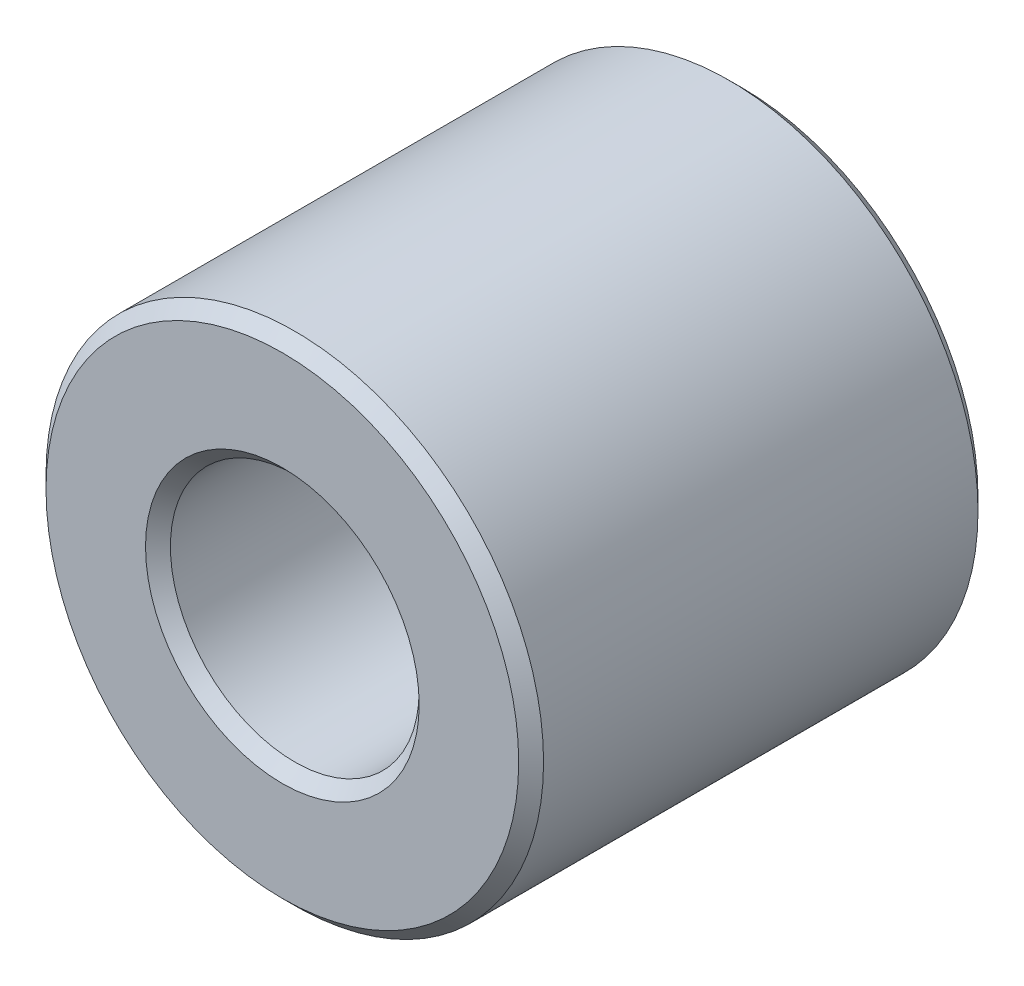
ISO-10303-21;
HEADER;
FILE_DESCRIPTION(('STEP AP214'),'2;1');
FILE_NAME('part.step','',(''),(''),'','','');
FILE_SCHEMA(('AUTOMOTIVE_DESIGN { 1 0 10303 214 1 1 1 1 }'));
ENDSEC;
DATA;
#1=APPLICATION_CONTEXT('core data for automotive mechanical design processes');
#2=APPLICATION_PROTOCOL_DEFINITION('international standard','automotive_design',2000,#1);
#3=PRODUCT_CONTEXT('',#1,'mechanical');
#4=PRODUCT('Part','Part','',(#3));
#5=PRODUCT_RELATED_PRODUCT_CATEGORY('part','',(#4));
#6=PRODUCT_DEFINITION_FORMATION('','',#4);
#7=PRODUCT_DEFINITION_CONTEXT('part definition',#1,'design');
#8=PRODUCT_DEFINITION('design','',#6,#7);
#9=PRODUCT_DEFINITION_SHAPE('','',#8);
#10=(LENGTH_UNIT() NAMED_UNIT(*) SI_UNIT(.MILLI.,.METRE.));
#11=(NAMED_UNIT(*) PLANE_ANGLE_UNIT() SI_UNIT($,.RADIAN.));
#12=(NAMED_UNIT(*) SI_UNIT($,.STERADIAN.) SOLID_ANGLE_UNIT());
#13=UNCERTAINTY_MEASURE_WITH_UNIT(LENGTH_MEASURE(1.E-05),#10,'distance_accuracy_value','');
#14=(GEOMETRIC_REPRESENTATION_CONTEXT(3) GLOBAL_UNCERTAINTY_ASSIGNED_CONTEXT((#13)) GLOBAL_UNIT_ASSIGNED_CONTEXT((#10,
#11,#12)) REPRESENTATION_CONTEXT('',''));
#15=CARTESIAN_POINT('',(0.,0.,0.));
#16=DIRECTION('',(0.,0.,1.));
#17=DIRECTION('',(1.,0.,0.));
#18=AXIS2_PLACEMENT_3D('',#15,#16,#17);
#19=CARTESIAN_POINT('',(0.,0.,12.));
#20=DIRECTION('',(0.,0.,1.));
#21=DIRECTION('',(1.,0.,0.));
#22=AXIS2_PLACEMENT_3D('',#19,#20,#21);
#23=PLANE('',#22);
#24=CARTESIAN_POINT('',(0.,0.,12.));
#25=DIRECTION('',(0.,0.,1.));
#26=DIRECTION('',(1.,0.,0.));
#27=AXIS2_PLACEMENT_3D('',#24,#25,#26);
#28=CIRCLE('',#27,7.15);
#29=CARTESIAN_POINT('',(7.15,0.,12.));
#30=VERTEX_POINT('',#29);
#31=EDGE_CURVE('E10',#30,#30,#28,.F.);
#32=ORIENTED_EDGE('',*,*,#31,.T.);
#33=EDGE_LOOP('',(#32));
#34=FACE_BOUND('',#33,.T.);
#35=CARTESIAN_POINT('',(0.,0.,12.));
#36=DIRECTION('',(0.,0.,1.));
#37=DIRECTION('',(1.,0.,0.));
#38=AXIS2_PLACEMENT_3D('',#35,#36,#37);
#39=CIRCLE('',#38,12.35);
#40=CARTESIAN_POINT('',(12.35,0.,12.));
#41=VERTEX_POINT('',#40);
#42=EDGE_CURVE('E45',#41,#41,#39,.T.);
#43=ORIENTED_EDGE('',*,*,#42,.T.);
#44=EDGE_LOOP('',(#43));
#45=FACE_BOUND('',#44,.T.);
#46=ADVANCED_FACE('F37',(#34,#45),#23,.T.);
#47=CARTESIAN_POINT('',(0.,0.,-12.));
#48=DIRECTION('',(0.,0.,1.));
#49=DIRECTION('',(1.,0.,0.));
#50=AXIS2_PLACEMENT_3D('',#47,#48,#49);
#51=PLANE('',#50);
#52=CARTESIAN_POINT('',(0.,0.,-12.));
#53=DIRECTION('',(0.,0.,1.));
#54=DIRECTION('',(1.,0.,0.));
#55=AXIS2_PLACEMENT_3D('',#52,#53,#54);
#56=CIRCLE('',#55,7.14999999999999);
#57=CARTESIAN_POINT('',(7.14999999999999,0.,-12.));
#58=VERTEX_POINT('',#57);
#59=EDGE_CURVE('E70',#58,#58,#56,.T.);
#60=ORIENTED_EDGE('',*,*,#59,.T.);
#61=EDGE_LOOP('',(#60));
#62=FACE_BOUND('',#61,.T.);
#63=CARTESIAN_POINT('',(0.,0.,-12.));
#64=DIRECTION('',(0.,0.,1.));
#65=DIRECTION('',(1.,0.,0.));
#66=AXIS2_PLACEMENT_3D('',#63,#64,#65);
#67=CIRCLE('',#66,12.35);
#68=CARTESIAN_POINT('',(12.35,0.,-12.));
#69=VERTEX_POINT('',#68);
#70=EDGE_CURVE('E73',#69,#69,#67,.F.);
#71=ORIENTED_EDGE('',*,*,#70,.T.);
#72=EDGE_LOOP('',(#71));
#73=FACE_BOUND('',#72,.T.);
#74=ADVANCED_FACE('F78',(#62,#73),#51,.F.);
#75=CARTESIAN_POINT('',(0.,0.,12.));
#76=DIRECTION('',(0.,0.,-1.));
#77=DIRECTION('',(-1.,0.,0.));
#78=AXIS2_PLACEMENT_3D('',#75,#76,#77);
#79=CYLINDRICAL_SURFACE('',#78,13.);
#80=CARTESIAN_POINT('',(0.,0.,-11.35));
#81=DIRECTION('',(0.,0.,1.));
#82=DIRECTION('',(1.,0.,0.));
#83=AXIS2_PLACEMENT_3D('',#80,#81,#82);
#84=CIRCLE('',#83,13.);
#85=CARTESIAN_POINT('',(13.,0.,-11.35));
#86=VERTEX_POINT('',#85);
#87=EDGE_CURVE('E51',#86,#86,#84,.T.);
#88=ORIENTED_EDGE('',*,*,#87,.T.);
#89=EDGE_LOOP('',(#88));
#90=FACE_BOUND('',#89,.T.);
#91=CARTESIAN_POINT('',(0.,0.,11.35));
#92=DIRECTION('',(0.,0.,1.));
#93=DIRECTION('',(1.,0.,0.));
#94=AXIS2_PLACEMENT_3D('',#91,#92,#93);
#95=CIRCLE('',#94,13.);
#96=CARTESIAN_POINT('',(13.,0.,11.35));
#97=VERTEX_POINT('',#96);
#98=EDGE_CURVE('E58',#97,#97,#95,.F.);
#99=ORIENTED_EDGE('',*,*,#98,.T.);
#100=EDGE_LOOP('',(#99));
#101=FACE_BOUND('',#100,.T.);
#102=ADVANCED_FACE('F88',(#90,#101),#79,.T.);
#103=CARTESIAN_POINT('',(0.,0.,12.));
#104=DIRECTION('',(0.,0.,-1.));
#105=DIRECTION('',(-1.,0.,0.));
#106=AXIS2_PLACEMENT_3D('',#103,#104,#105);
#107=CYLINDRICAL_SURFACE('',#106,6.5);
#108=CARTESIAN_POINT('',(0.,0.,-11.35));
#109=DIRECTION('',(0.,0.,1.));
#110=DIRECTION('',(1.,0.,0.));
#111=AXIS2_PLACEMENT_3D('',#108,#109,#110);
#112=CIRCLE('',#111,6.5);
#113=CARTESIAN_POINT('',(6.5,0.,-11.35));
#114=VERTEX_POINT('',#113);
#115=EDGE_CURVE('E64',#114,#114,#112,.F.);
#116=ORIENTED_EDGE('',*,*,#115,.T.);
#117=EDGE_LOOP('',(#116));
#118=FACE_BOUND('',#117,.T.);
#119=CARTESIAN_POINT('',(0.,0.,11.35));
#120=DIRECTION('',(0.,0.,1.));
#121=DIRECTION('',(1.,0.,0.));
#122=AXIS2_PLACEMENT_3D('',#119,#120,#121);
#123=CIRCLE('',#122,6.5);
#124=CARTESIAN_POINT('',(6.5,0.,11.35));
#125=VERTEX_POINT('',#124);
#126=EDGE_CURVE('E67',#125,#125,#123,.T.);
#127=ORIENTED_EDGE('',*,*,#126,.T.);
#128=EDGE_LOOP('',(#127));
#129=FACE_BOUND('',#128,.T.);
#130=ADVANCED_FACE('F91',(#118,#129),#107,.F.);
#131=CARTESIAN_POINT('',(0.,0.,-12.));
#132=DIRECTION('',(0.,0.,-1.));
#133=DIRECTION('',(-1.,0.,0.));
#134=AXIS2_PLACEMENT_3D('',#131,#132,#133);
#135=CONICAL_SURFACE('',#134,7.14999999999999,0.785398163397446);
#136=ORIENTED_EDGE('',*,*,#115,.F.);
#137=EDGE_LOOP('',(#136));
#138=FACE_BOUND('',#137,.T.);
#139=ORIENTED_EDGE('',*,*,#59,.F.);
#140=EDGE_LOOP('',(#139));
#141=FACE_BOUND('',#140,.T.);
#142=ADVANCED_FACE('F84',(#138,#141),#135,.F.);
#143=CARTESIAN_POINT('',(0.,0.,-11.35));
#144=DIRECTION('',(0.,0.,1.));
#145=DIRECTION('',(1.,0.,0.));
#146=AXIS2_PLACEMENT_3D('',#143,#144,#145);
#147=CONICAL_SURFACE('',#146,13.,0.785398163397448);
#148=ORIENTED_EDGE('',*,*,#70,.F.);
#149=EDGE_LOOP('',(#148));
#150=FACE_BOUND('',#149,.T.);
#151=ORIENTED_EDGE('',*,*,#87,.F.);
#152=EDGE_LOOP('',(#151));
#153=FACE_BOUND('',#152,.T.);
#154=ADVANCED_FACE('F80',(#150,#153),#147,.T.);
#155=CARTESIAN_POINT('',(0.,0.,11.35));
#156=DIRECTION('',(0.,0.,1.));
#157=DIRECTION('',(1.,0.,0.));
#158=AXIS2_PLACEMENT_3D('',#155,#156,#157);
#159=CONICAL_SURFACE('',#158,6.5,0.785398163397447);
#160=CARTESIAN_POINT('',(7.15,0.,12.));
#161=CARTESIAN_POINT('',(7.14322916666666,0.,11.9932291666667));
#162=CARTESIAN_POINT('',(7.13645833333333,0.,11.9864583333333));
#163=CARTESIAN_POINT('',(7.12291666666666,0.,11.9729166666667));
#164=CARTESIAN_POINT('',(7.11614583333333,0.,11.9661458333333));
#165=CARTESIAN_POINT('',(7.10260416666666,0.,11.9526041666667));
#166=CARTESIAN_POINT('',(7.09583333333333,0.,11.9458333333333));
#167=CARTESIAN_POINT('',(7.08229166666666,0.,11.9322916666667));
#168=CARTESIAN_POINT('',(7.07552083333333,0.,11.9255208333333));
#169=CARTESIAN_POINT('',(7.06197916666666,0.,11.9119791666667));
#170=CARTESIAN_POINT('',(7.05520833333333,0.,11.9052083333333));
#171=CARTESIAN_POINT('',(7.04166666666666,0.,11.8916666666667));
#172=CARTESIAN_POINT('',(7.03489583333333,0.,11.8848958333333));
#173=CARTESIAN_POINT('',(7.02135416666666,0.,11.8713541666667));
#174=CARTESIAN_POINT('',(7.01458333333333,0.,11.8645833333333));
#175=CARTESIAN_POINT('',(7.00104166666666,0.,11.8510416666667));
#176=CARTESIAN_POINT('',(6.99427083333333,0.,11.8442708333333));
#177=CARTESIAN_POINT('',(6.98072916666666,0.,11.8307291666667));
#178=CARTESIAN_POINT('',(6.97395833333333,0.,11.8239583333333));
#179=CARTESIAN_POINT('',(6.96041666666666,0.,11.8104166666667));
#180=CARTESIAN_POINT('',(6.95364583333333,0.,11.8036458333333));
#181=CARTESIAN_POINT('',(6.94010416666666,0.,11.7901041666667));
#182=CARTESIAN_POINT('',(6.93333333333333,0.,11.7833333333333));
#183=CARTESIAN_POINT('',(6.91979166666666,0.,11.7697916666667));
#184=CARTESIAN_POINT('',(6.91302083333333,0.,11.7630208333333));
#185=CARTESIAN_POINT('',(6.89947916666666,0.,11.7494791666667));
#186=CARTESIAN_POINT('',(6.89270833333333,0.,11.7427083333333));
#187=CARTESIAN_POINT('',(6.87916666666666,0.,11.7291666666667));
#188=CARTESIAN_POINT('',(6.87239583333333,0.,11.7223958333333));
#189=CARTESIAN_POINT('',(6.85885416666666,0.,11.7088541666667));
#190=CARTESIAN_POINT('',(6.85208333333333,0.,11.7020833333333));
#191=CARTESIAN_POINT('',(6.83854166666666,0.,11.6885416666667));
#192=CARTESIAN_POINT('',(6.83177083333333,0.,11.6817708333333));
#193=CARTESIAN_POINT('',(6.81822916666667,0.,11.6682291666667));
#194=CARTESIAN_POINT('',(6.81145833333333,0.,11.6614583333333));
#195=CARTESIAN_POINT('',(6.79791666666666,0.,11.6479166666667));
#196=CARTESIAN_POINT('',(6.79114583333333,0.,11.6411458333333));
#197=CARTESIAN_POINT('',(6.77760416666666,0.,11.6276041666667));
#198=CARTESIAN_POINT('',(6.77083333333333,0.,11.6208333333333));
#199=CARTESIAN_POINT('',(6.75729166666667,0.,11.6072916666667));
#200=CARTESIAN_POINT('',(6.75052083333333,0.,11.6005208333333));
#201=CARTESIAN_POINT('',(6.73697916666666,0.,11.5869791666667));
#202=CARTESIAN_POINT('',(6.73020833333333,0.,11.5802083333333));
#203=CARTESIAN_POINT('',(6.71666666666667,0.,11.5666666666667));
#204=CARTESIAN_POINT('',(6.70989583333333,0.,11.5598958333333));
#205=CARTESIAN_POINT('',(6.69635416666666,0.,11.5463541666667));
#206=CARTESIAN_POINT('',(6.68958333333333,0.,11.5395833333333));
#207=CARTESIAN_POINT('',(6.67604166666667,0.,11.5260416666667));
#208=CARTESIAN_POINT('',(6.66927083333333,0.,11.5192708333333));
#209=CARTESIAN_POINT('',(6.65572916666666,0.,11.5057291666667));
#210=CARTESIAN_POINT('',(6.64895833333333,0.,11.4989583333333));
#211=CARTESIAN_POINT('',(6.63541666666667,0.,11.4854166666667));
#212=CARTESIAN_POINT('',(6.62864583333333,0.,11.4786458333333));
#213=CARTESIAN_POINT('',(6.61510416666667,0.,11.4651041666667));
#214=CARTESIAN_POINT('',(6.60833333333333,0.,11.4583333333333));
#215=CARTESIAN_POINT('',(6.59479166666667,0.,11.4447916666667));
#216=CARTESIAN_POINT('',(6.58802083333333,0.,11.4380208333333));
#217=CARTESIAN_POINT('',(6.57447916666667,0.,11.4244791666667));
#218=CARTESIAN_POINT('',(6.56770833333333,0.,11.4177083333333));
#219=CARTESIAN_POINT('',(6.55416666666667,0.,11.4041666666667));
#220=CARTESIAN_POINT('',(6.54739583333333,0.,11.3973958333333));
#221=CARTESIAN_POINT('',(6.53385416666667,0.,11.3838541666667));
#222=CARTESIAN_POINT('',(6.52708333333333,0.,11.3770833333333));
#223=CARTESIAN_POINT('',(6.51354166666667,0.,11.3635416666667));
#224=CARTESIAN_POINT('',(6.50677083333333,0.,11.3567708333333));
#225=CARTESIAN_POINT('',(6.5,0.,11.35));
#226=B_SPLINE_CURVE_WITH_KNOTS('',3,(#160,#161,#162,#163,#164,#165,#166,#167,#168,#169,#170,
#171,#172,#173,#174,#175,#176,#177,#178,#179,#180,#181,#182,#183,#184,#185,#186,#187,#188,#189,
#190,#191,#192,#193,#194,#195,#196,#197,#198,#199,#200,#201,#202,#203,#204,#205,#206,#207,#208,
#209,#210,#211,#212,#213,#214,#215,#216,#217,#218,#219,#220,#221,#222,#223,#224,#225),
.UNSPECIFIED.,.F.,.F.,(4,2,2,2,2,2,2,2,2,2,2,2,2,2,2,2,2,2,2,2,2,2,2,2,2,2,2,2,2,2,2,2,4),(0.,
0.0287262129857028,0.0574524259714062,0.086178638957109,0.114904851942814,0.143631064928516,
0.17235727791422,0.201083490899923,0.229809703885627,0.25853591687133,0.287262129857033,
0.315988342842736,0.34471455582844,0.373440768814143,0.402166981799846,0.43089319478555,
0.459619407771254,0.488345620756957,0.51707183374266,0.545798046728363,0.574524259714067,
0.60325047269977,0.631976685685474,0.660702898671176,0.689429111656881,0.718155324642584,
0.746881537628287,0.77560775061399,0.804333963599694,0.833060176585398,0.8617863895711,
0.890512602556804,0.919238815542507),.UNSPECIFIED.);
#227=EDGE_CURVE('BSEAM83',#30,#125,#226,.T.);
#228=ORIENTED_EDGE('',*,*,#31,.F.);
#229=ORIENTED_EDGE('',*,*,#126,.F.);
#230=ORIENTED_EDGE('',*,*,#227,.T.);
#231=ORIENTED_EDGE('',*,*,#227,.F.);
#232=EDGE_LOOP('',(#228,#230,#229,#231));
#233=FACE_BOUND('',#232,.T.);
#234=ADVANCED_FACE('F83',(#233),#159,.F.);
#235=CARTESIAN_POINT('',(0.,0.,12.));
#236=DIRECTION('',(0.,0.,-1.));
#237=DIRECTION('',(-1.,0.,0.));
#238=AXIS2_PLACEMENT_3D('',#235,#236,#237);
#239=CONICAL_SURFACE('',#238,12.35,0.785398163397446);
#240=ORIENTED_EDGE('',*,*,#98,.F.);
#241=EDGE_LOOP('',(#240));
#242=FACE_BOUND('',#241,.T.);
#243=ORIENTED_EDGE('',*,*,#42,.F.);
#244=EDGE_LOOP('',(#243));
#245=FACE_BOUND('',#244,.T.);
#246=ADVANCED_FACE('F39',(#242,#245),#239,.T.);
#247=CLOSED_SHELL('',(#46,#74,#102,#130,#142,#154,#234,#246));
#248=MANIFOLD_SOLID_BREP('B2',#247);
#249=ADVANCED_BREP_SHAPE_REPRESENTATION('',(#18,#248),#14);
#250=SHAPE_DEFINITION_REPRESENTATION(#9,#249);
ENDSEC;
END-ISO-10303-21;
